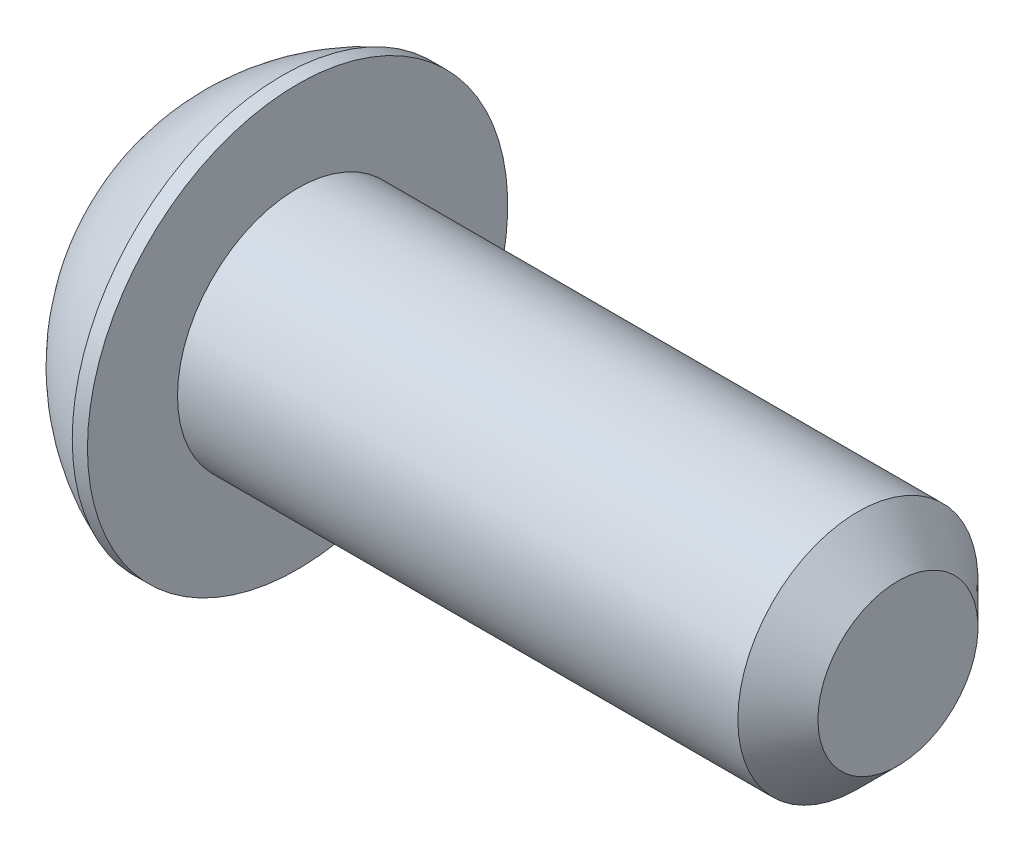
from build123d import *

# Parameters (mm, degrees)
HEX_2_DEPTH = 2.08


with BuildPart() as part:
    # BodySke → BaseBody (revolve)
    with BuildSketch(Plane.XY, mode=Mode.PRIVATE) as basebody_sk:
        with BuildLine():
            Line((18.3, 0), (18.3, 2))
            Line((18.3, 2), (17.3, 3))
            Line((17.3, 3), (3.3, 3))
            Line((3.3, 3), (3.3, 5.25))
            Line((3.3, 5.25), (2.92, 5.25))
            ThreePointArc((2.92, 5.25), (1.224500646, 4.199464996), (0, 2.625))
            Line((0, 2.625), (0, 0))
            Line((0, 0), (18.3, 0))
        make_face()
    revolve(basebody_sk.sketch.rotate(Axis((0, 0, 0), (1, 0, 0)), 90), axis=Axis((0, 0, 0), (1, 0, 0)))

    # Sketch2 → PreBroach (revolve, cut)
    with BuildSketch(Plane.XY, mode=Mode.PRIVATE) as prebroach_sk:
        Polygon((0, 2), (2.08, 2), (3.234700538, 0), (0, 0), align=None)
    revolve(prebroach_sk.sketch.rotate(Axis((0, 0, 0), (1, 0, 0)), 90), axis=Axis((0, 0, 0), (1, 0, 0)), mode=Mode.SUBTRACT)

    # Sketch3 → Hex 2 (cut)
    with BuildSketch(Plane(origin=(0, 0, 0), x_dir=(0, 0, -1), z_dir=(1, 0, 0))):
        Polygon((-2, -1.154700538), (-2, 1.154700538), (0, 2.309401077), (2, 1.154700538), (2, -1.154700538), (0, -2.309401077), align=None)
    extrude(amount=HEX_2_DEPTH, mode=Mode.SUBTRACT)


solid = part.part
